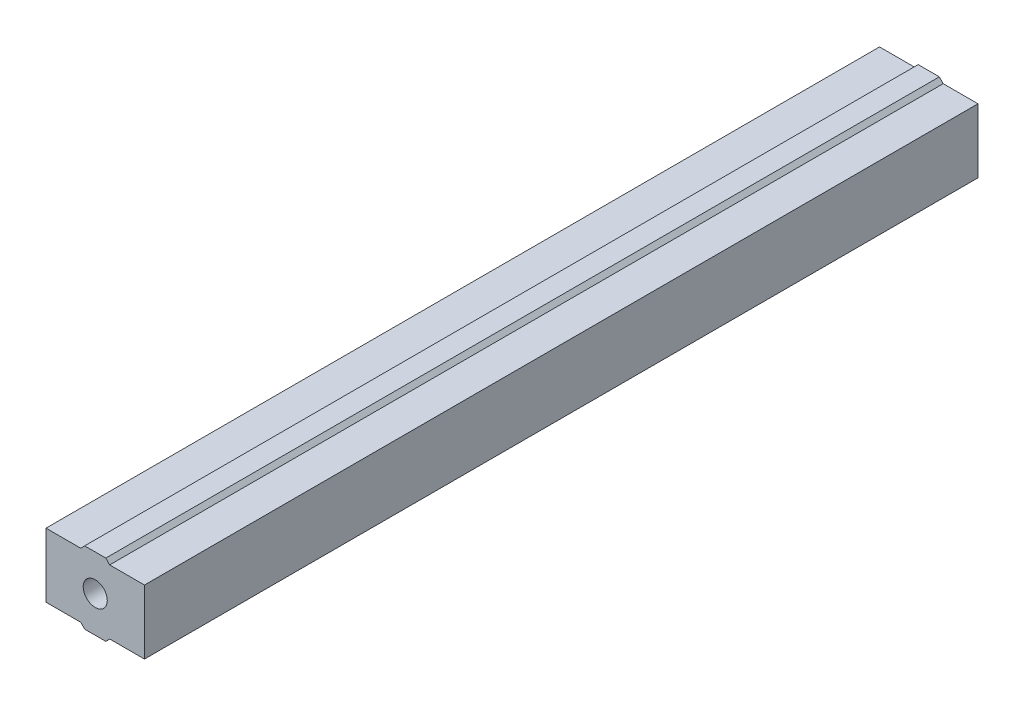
from build123d import *

# Parameters (mm, degrees)
SKETCH1_R      = 4.7625
EXTRUDE1_DEPTH = 330


with BuildPart() as part:
    # Sketch1 → Extrude1 (new body)
    with BuildSketch(Plane.XY):
        Polygon((-19.4945, -12.7), (-5.715, -12.7), (-4.191, -14.2875), (4.191, -14.2875), (5.715, -12.7), (19.4945, -12.7), (19.4945, 12.7), (5.715, 12.7), (4.191, 14.2875), (-4.191, 14.2875), (-5.715, 12.7), (-19.4945, 12.7), align=None)
        Circle(SKETCH1_R, mode=Mode.SUBTRACT)
    extrude(amount=EXTRUDE1_DEPTH)


solid = part.part
